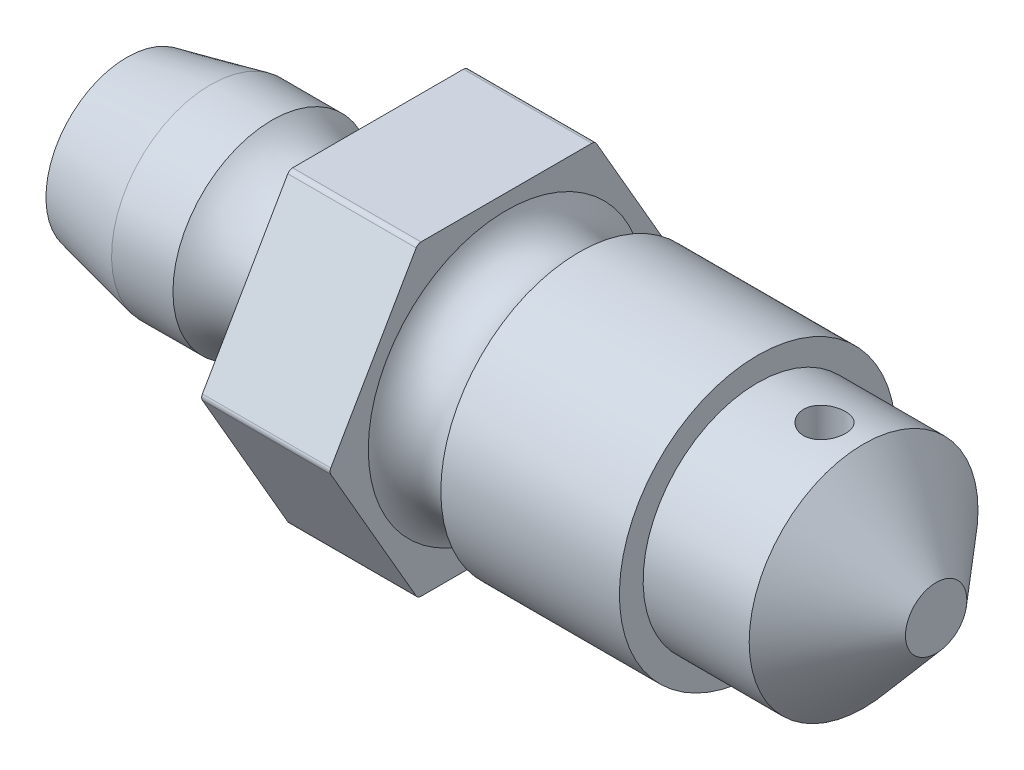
ISO-10303-21;
HEADER;
FILE_DESCRIPTION(('STEP AP214'),'2;1');
FILE_NAME('part.step','',(''),(''),'','','');
FILE_SCHEMA(('AUTOMOTIVE_DESIGN { 1 0 10303 214 1 1 1 1 }'));
ENDSEC;
DATA;
#1=APPLICATION_CONTEXT('core data for automotive mechanical design processes');
#2=APPLICATION_PROTOCOL_DEFINITION('international standard','automotive_design',2000,#1);
#3=PRODUCT_CONTEXT('',#1,'mechanical');
#4=PRODUCT('Part','Part','',(#3));
#5=PRODUCT_RELATED_PRODUCT_CATEGORY('part','',(#4));
#6=PRODUCT_DEFINITION_FORMATION('','',#4);
#7=PRODUCT_DEFINITION_CONTEXT('part definition',#1,'design');
#8=PRODUCT_DEFINITION('design','',#6,#7);
#9=PRODUCT_DEFINITION_SHAPE('','',#8);
#10=(LENGTH_UNIT() NAMED_UNIT(*) SI_UNIT(.MILLI.,.METRE.));
#11=(NAMED_UNIT(*) PLANE_ANGLE_UNIT() SI_UNIT($,.RADIAN.));
#12=(NAMED_UNIT(*) SI_UNIT($,.STERADIAN.) SOLID_ANGLE_UNIT());
#13=UNCERTAINTY_MEASURE_WITH_UNIT(LENGTH_MEASURE(1.E-05),#10,'distance_accuracy_value','');
#14=(GEOMETRIC_REPRESENTATION_CONTEXT(3) GLOBAL_UNCERTAINTY_ASSIGNED_CONTEXT((#13)) GLOBAL_UNIT_ASSIGNED_CONTEXT((#10,
#11,#12)) REPRESENTATION_CONTEXT('',''));
#15=CARTESIAN_POINT('',(0.,0.,0.));
#16=DIRECTION('',(0.,0.,1.));
#17=DIRECTION('',(1.,0.,0.));
#18=AXIS2_PLACEMENT_3D('',#15,#16,#17);
#19=CARTESIAN_POINT('',(9.,3.55,0.));
#20=DIRECTION('',(-1.,0.,0.));
#21=DIRECTION('',(0.,-1.,0.));
#22=AXIS2_PLACEMENT_3D('',#19,#20,#21);
#23=PLANE('',#22);
#24=CARTESIAN_POINT('',(9.,0.,0.));
#25=DIRECTION('',(-1.,0.,0.));
#26=DIRECTION('',(0.,0.,1.));
#27=AXIS2_PLACEMENT_3D('',#24,#25,#26);
#28=CIRCLE('',#27,3.55);
#29=CARTESIAN_POINT('',(9.,0.,3.55));
#30=VERTEX_POINT('',#29);
#31=EDGE_CURVE('E146',#30,#30,#28,.T.);
#32=ORIENTED_EDGE('',*,*,#31,.F.);
#33=EDGE_LOOP('',(#32));
#34=FACE_BOUND('',#33,.T.);
#35=DIRECTION('',(0.,0.866025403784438,-0.5));
#36=VECTOR('',#35,1.);
#37=CARTESIAN_POINT('',(9.,0.,6.35085296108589));
#38=LINE('',#37,#36);
#39=CARTESIAN_POINT('',(9.,0.1,6.29311793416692));
#40=VERTEX_POINT('',#39);
#41=CARTESIAN_POINT('',(9.,5.4,3.2331615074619));
#42=VERTEX_POINT('',#41);
#43=EDGE_CURVE('E348',#40,#42,#38,.T.);
#44=ORIENTED_EDGE('',*,*,#43,.T.);
#45=CARTESIAN_POINT('',(9.,5.3,3.05995642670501));
#46=DIRECTION('',(-1.,0.,0.));
#47=DIRECTION('',(0.,-1.,0.));
#48=AXIS2_PLACEMENT_3D('',#45,#46,#47);
#49=CIRCLE('',#48,0.2);
#50=CARTESIAN_POINT('',(9.,5.5,3.05995642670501));
#51=VERTEX_POINT('',#50);
#52=EDGE_CURVE('E388',#42,#51,#49,.T.);
#53=ORIENTED_EDGE('',*,*,#52,.T.);
#54=DIRECTION('',(0.,0.,-1.));
#55=VECTOR('',#54,1.);
#56=CARTESIAN_POINT('',(9.,5.5,3.17542648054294));
#57=LINE('',#56,#55);
#58=CARTESIAN_POINT('',(9.,5.5,-3.05995642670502));
#59=VERTEX_POINT('',#58);
#60=EDGE_CURVE('E343',#51,#59,#57,.T.);
#61=ORIENTED_EDGE('',*,*,#60,.T.);
#62=CARTESIAN_POINT('',(9.,5.3,-3.05995642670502));
#63=DIRECTION('',(-1.,0.,0.));
#64=DIRECTION('',(0.,-1.,0.));
#65=AXIS2_PLACEMENT_3D('',#62,#63,#64);
#66=CIRCLE('',#65,0.2);
#67=CARTESIAN_POINT('',(9.,5.4,-3.2331615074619));
#68=VERTEX_POINT('',#67);
#69=EDGE_CURVE('E382',#59,#68,#66,.T.);
#70=ORIENTED_EDGE('',*,*,#69,.T.);
#71=DIRECTION('',(0.,-0.866025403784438,-0.5));
#72=VECTOR('',#71,1.);
#73=CARTESIAN_POINT('',(9.,5.5,-3.17542648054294));
#74=LINE('',#73,#72);
#75=CARTESIAN_POINT('',(9.,0.100000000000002,-6.29311793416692));
#76=VERTEX_POINT('',#75);
#77=EDGE_CURVE('E342',#68,#76,#74,.T.);
#78=ORIENTED_EDGE('',*,*,#77,.T.);
#79=CARTESIAN_POINT('',(9.,0.,-6.11991285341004));
#80=DIRECTION('',(-1.,0.,0.));
#81=DIRECTION('',(0.,-1.,0.));
#82=AXIS2_PLACEMENT_3D('',#79,#80,#81);
#83=CIRCLE('',#82,0.2);
#84=CARTESIAN_POINT('',(9.,-0.0999999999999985,-6.29311793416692));
#85=VERTEX_POINT('',#84);
#86=EDGE_CURVE('E341',#76,#85,#83,.T.);
#87=ORIENTED_EDGE('',*,*,#86,.T.);
#88=DIRECTION('',(0.,-0.866025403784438,0.5));
#89=VECTOR('',#88,1.);
#90=CARTESIAN_POINT('',(9.,0.,-6.35085296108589));
#91=LINE('',#90,#89);
#92=CARTESIAN_POINT('',(9.,-5.4,-3.2331615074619));
#93=VERTEX_POINT('',#92);
#94=EDGE_CURVE('E333',#85,#93,#91,.T.);
#95=ORIENTED_EDGE('',*,*,#94,.T.);
#96=CARTESIAN_POINT('',(9.,-5.3,-3.05995642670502));
#97=DIRECTION('',(-1.,0.,0.));
#98=DIRECTION('',(0.,-1.,0.));
#99=AXIS2_PLACEMENT_3D('',#96,#97,#98);
#100=CIRCLE('',#99,0.2);
#101=CARTESIAN_POINT('',(9.,-5.5,-3.05995642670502));
#102=VERTEX_POINT('',#101);
#103=EDGE_CURVE('E338',#93,#102,#100,.T.);
#104=ORIENTED_EDGE('',*,*,#103,.T.);
#105=DIRECTION('',(0.,0.,1.));
#106=VECTOR('',#105,1.);
#107=CARTESIAN_POINT('',(9.,-5.5,-3.17542648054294));
#108=LINE('',#107,#106);
#109=CARTESIAN_POINT('',(9.,-5.5,3.05995642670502));
#110=VERTEX_POINT('',#109);
#111=EDGE_CURVE('E189',#102,#110,#108,.T.);
#112=ORIENTED_EDGE('',*,*,#111,.T.);
#113=CARTESIAN_POINT('',(9.,-5.3,3.05995642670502));
#114=DIRECTION('',(-1.,0.,0.));
#115=DIRECTION('',(0.,-1.,0.));
#116=AXIS2_PLACEMENT_3D('',#113,#114,#115);
#117=CIRCLE('',#116,0.2);
#118=CARTESIAN_POINT('',(9.,-5.4,3.23316150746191));
#119=VERTEX_POINT('',#118);
#120=EDGE_CURVE('E355',#110,#119,#117,.T.);
#121=ORIENTED_EDGE('',*,*,#120,.T.);
#122=DIRECTION('',(0.,0.866025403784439,0.5));
#123=VECTOR('',#122,1.);
#124=CARTESIAN_POINT('',(9.,-5.5,3.17542648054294));
#125=LINE('',#124,#123);
#126=CARTESIAN_POINT('',(9.,-0.0999999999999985,6.29311793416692));
#127=VERTEX_POINT('',#126);
#128=EDGE_CURVE('E350',#119,#127,#125,.T.);
#129=ORIENTED_EDGE('',*,*,#128,.T.);
#130=CARTESIAN_POINT('',(9.,0.,6.11991285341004));
#131=DIRECTION('',(-1.,0.,0.));
#132=DIRECTION('',(0.,-1.,0.));
#133=AXIS2_PLACEMENT_3D('',#130,#131,#132);
#134=CIRCLE('',#133,0.2);
#135=EDGE_CURVE('E353',#127,#40,#134,.T.);
#136=ORIENTED_EDGE('',*,*,#135,.T.);
#137=EDGE_LOOP('',(#44,#53,#61,#70,#78,#87,#95,#104,#112,#121,#129,#136));
#138=FACE_BOUND('',#137,.T.);
#139=ADVANCED_FACE('F41',(#34,#138),#23,.T.);
#140=CARTESIAN_POINT('',(13.6,6.5,0.));
#141=DIRECTION('',(1.,0.,0.));
#142=DIRECTION('',(0.,1.,0.));
#143=AXIS2_PLACEMENT_3D('',#140,#141,#142);
#144=PLANE('',#143);
#145=CARTESIAN_POINT('',(13.6,0.,0.));
#146=DIRECTION('',(-1.,0.,0.));
#147=DIRECTION('',(0.,0.,1.));
#148=AXIS2_PLACEMENT_3D('',#145,#146,#147);
#149=CIRCLE('',#148,4.95);
#150=CARTESIAN_POINT('',(13.6,0.,4.95));
#151=VERTEX_POINT('',#150);
#152=EDGE_CURVE('E153',#151,#151,#149,.T.);
#153=ORIENTED_EDGE('',*,*,#152,.T.);
#154=EDGE_LOOP('',(#153));
#155=FACE_BOUND('',#154,.T.);
#156=DIRECTION('',(0.,0.,1.));
#157=VECTOR('',#156,1.);
#158=CARTESIAN_POINT('',(13.6,5.5,0.));
#159=LINE('',#158,#157);
#160=CARTESIAN_POINT('',(13.6,5.5,-3.05995642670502));
#161=VERTEX_POINT('',#160);
#162=CARTESIAN_POINT('',(13.6,5.5,3.05995642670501));
#163=VERTEX_POINT('',#162);
#164=EDGE_CURVE('E397',#161,#163,#159,.T.);
#165=ORIENTED_EDGE('',*,*,#164,.T.);
#166=CARTESIAN_POINT('',(13.6,5.3,3.05995642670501));
#167=DIRECTION('',(1.,0.,0.));
#168=DIRECTION('',(0.,1.,0.));
#169=AXIS2_PLACEMENT_3D('',#166,#167,#168);
#170=CIRCLE('',#169,0.2);
#171=CARTESIAN_POINT('',(13.6,5.4,3.2331615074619));
#172=VERTEX_POINT('',#171);
#173=EDGE_CURVE('E312',#163,#172,#170,.T.);
#174=ORIENTED_EDGE('',*,*,#173,.T.);
#175=DIRECTION('',(0.,-0.866025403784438,0.5));
#176=VECTOR('',#175,1.);
#177=CARTESIAN_POINT('',(13.6,7.625,1.94855715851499));
#178=LINE('',#177,#176);
#179=CARTESIAN_POINT('',(13.6,0.0999999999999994,6.29311793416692));
#180=VERTEX_POINT('',#179);
#181=EDGE_CURVE('E403',#172,#180,#178,.T.);
#182=ORIENTED_EDGE('',*,*,#181,.T.);
#183=CARTESIAN_POINT('',(13.6,0.,6.11991285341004));
#184=DIRECTION('',(1.,0.,0.));
#185=DIRECTION('',(0.,1.,0.));
#186=AXIS2_PLACEMENT_3D('',#183,#184,#185);
#187=CIRCLE('',#186,0.2);
#188=CARTESIAN_POINT('',(13.6,-0.0999999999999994,6.29311793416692));
#189=VERTEX_POINT('',#188);
#190=EDGE_CURVE('E310',#180,#189,#187,.T.);
#191=ORIENTED_EDGE('',*,*,#190,.T.);
#192=DIRECTION('',(0.,-0.866025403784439,-0.5));
#193=VECTOR('',#192,1.);
#194=CARTESIAN_POINT('',(13.6,2.125,7.57772228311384));
#195=LINE('',#194,#193);
#196=CARTESIAN_POINT('',(13.6,-5.4,3.23316150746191));
#197=VERTEX_POINT('',#196);
#198=EDGE_CURVE('E367',#189,#197,#195,.T.);
#199=ORIENTED_EDGE('',*,*,#198,.T.);
#200=CARTESIAN_POINT('',(13.6,-5.3,3.05995642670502));
#201=DIRECTION('',(1.,0.,0.));
#202=DIRECTION('',(0.,1.,0.));
#203=AXIS2_PLACEMENT_3D('',#200,#201,#202);
#204=CIRCLE('',#203,0.2);
#205=CARTESIAN_POINT('',(13.6,-5.5,3.05995642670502));
#206=VERTEX_POINT('',#205);
#207=EDGE_CURVE('E303',#197,#206,#204,.T.);
#208=ORIENTED_EDGE('',*,*,#207,.T.);
#209=DIRECTION('',(0.,0.,-1.));
#210=VECTOR('',#209,1.);
#211=CARTESIAN_POINT('',(13.6,-5.5,0.));
#212=LINE('',#211,#210);
#213=CARTESIAN_POINT('',(13.6,-5.5,-3.05995642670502));
#214=VERTEX_POINT('',#213);
#215=EDGE_CURVE('E366',#206,#214,#212,.T.);
#216=ORIENTED_EDGE('',*,*,#215,.T.);
#217=CARTESIAN_POINT('',(13.6,-5.3,-3.05995642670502));
#218=DIRECTION('',(1.,0.,0.));
#219=DIRECTION('',(0.,1.,0.));
#220=AXIS2_PLACEMENT_3D('',#217,#218,#219);
#221=CIRCLE('',#220,0.2);
#222=CARTESIAN_POINT('',(13.6,-5.4,-3.2331615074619));
#223=VERTEX_POINT('',#222);
#224=EDGE_CURVE('E300',#214,#223,#221,.T.);
#225=ORIENTED_EDGE('',*,*,#224,.T.);
#226=DIRECTION('',(0.,0.866025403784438,-0.5));
#227=VECTOR('',#226,1.);
#228=CARTESIAN_POINT('',(13.6,2.125,-7.57772228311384));
#229=LINE('',#228,#227);
#230=CARTESIAN_POINT('',(13.6,-0.0999999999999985,-6.29311793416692));
#231=VERTEX_POINT('',#230);
#232=EDGE_CURVE('E334',#223,#231,#229,.T.);
#233=ORIENTED_EDGE('',*,*,#232,.T.);
#234=CARTESIAN_POINT('',(13.6,0.,-6.11991285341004));
#235=DIRECTION('',(1.,0.,0.));
#236=DIRECTION('',(0.,1.,0.));
#237=AXIS2_PLACEMENT_3D('',#234,#235,#236);
#238=CIRCLE('',#237,0.2);
#239=CARTESIAN_POINT('',(13.6,0.100000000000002,-6.29311793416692));
#240=VERTEX_POINT('',#239);
#241=EDGE_CURVE('E62',#231,#240,#238,.T.);
#242=ORIENTED_EDGE('',*,*,#241,.T.);
#243=DIRECTION('',(0.,0.866025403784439,0.5));
#244=VECTOR('',#243,1.);
#245=CARTESIAN_POINT('',(13.6,7.625,-1.94855715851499));
#246=LINE('',#245,#244);
#247=CARTESIAN_POINT('',(13.6,5.4,-3.2331615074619));
#248=VERTEX_POINT('',#247);
#249=EDGE_CURVE('E374',#240,#248,#246,.T.);
#250=ORIENTED_EDGE('',*,*,#249,.T.);
#251=CARTESIAN_POINT('',(13.6,5.3,-3.05995642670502));
#252=DIRECTION('',(1.,0.,0.));
#253=DIRECTION('',(0.,1.,0.));
#254=AXIS2_PLACEMENT_3D('',#251,#252,#253);
#255=CIRCLE('',#254,0.2);
#256=EDGE_CURVE('E301',#248,#161,#255,.T.);
#257=ORIENTED_EDGE('',*,*,#256,.T.);
#258=EDGE_LOOP('',(#165,#174,#182,#191,#199,#208,#216,#225,#233,#242,#250,#257));
#259=FACE_BOUND('',#258,.T.);
#260=ADVANCED_FACE('F261',(#155,#259),#144,.T.);
#261=CARTESIAN_POINT('',(29.,0.,0.));
#262=DIRECTION('',(1.,0.,0.));
#263=DIRECTION('',(0.,1.,0.));
#264=AXIS2_PLACEMENT_3D('',#261,#262,#263);
#265=CYLINDRICAL_SURFACE('',#264,4.95);
#266=CARTESIAN_POINT('',(22.6,0.,0.));
#267=DIRECTION('',(1.,0.,0.));
#268=DIRECTION('',(0.,1.,0.));
#269=AXIS2_PLACEMENT_3D('',#266,#267,#268);
#270=CIRCLE('',#269,4.95);
#271=CARTESIAN_POINT('',(22.6,4.95,0.));
#272=VERTEX_POINT('',#271);
#273=EDGE_CURVE('E170',#272,#272,#270,.T.);
#274=ORIENTED_EDGE('',*,*,#273,.F.);
#275=EDGE_LOOP('',(#274));
#276=FACE_BOUND('',#275,.T.);
#277=CARTESIAN_POINT('',(16.2,0.,0.));
#278=DIRECTION('',(-1.,0.,0.));
#279=DIRECTION('',(0.,0.,1.));
#280=AXIS2_PLACEMENT_3D('',#277,#278,#279);
#281=CIRCLE('',#280,4.95);
#282=CARTESIAN_POINT('',(16.2,0.,4.95));
#283=VERTEX_POINT('',#282);
#284=EDGE_CURVE('E156',#283,#283,#281,.T.);
#285=ORIENTED_EDGE('',*,*,#284,.F.);
#286=EDGE_LOOP('',(#285));
#287=FACE_BOUND('',#286,.T.);
#288=ADVANCED_FACE('F267',(#276,#287),#265,.T.);
#289=CARTESIAN_POINT('',(22.6,4.95,0.));
#290=DIRECTION('',(1.,0.,0.));
#291=DIRECTION('',(0.,1.,0.));
#292=AXIS2_PLACEMENT_3D('',#289,#290,#291);
#293=PLANE('',#292);
#294=ORIENTED_EDGE('',*,*,#273,.T.);
#295=EDGE_LOOP('',(#294));
#296=FACE_BOUND('',#295,.T.);
#297=CARTESIAN_POINT('',(22.6,0.,0.));
#298=DIRECTION('',(1.,0.,0.));
#299=DIRECTION('',(0.,1.,0.));
#300=AXIS2_PLACEMENT_3D('',#297,#298,#299);
#301=CIRCLE('',#300,4.1);
#302=CARTESIAN_POINT('',(22.6,4.1,0.));
#303=VERTEX_POINT('',#302);
#304=EDGE_CURVE('E167',#303,#303,#301,.T.);
#305=ORIENTED_EDGE('',*,*,#304,.F.);
#306=EDGE_LOOP('',(#305));
#307=FACE_BOUND('',#306,.T.);
#308=ADVANCED_FACE('F418',(#296,#307),#293,.T.);
#309=CARTESIAN_POINT('',(29.,0.,0.));
#310=DIRECTION('',(1.,0.,0.));
#311=DIRECTION('',(0.,1.,0.));
#312=AXIS2_PLACEMENT_3D('',#309,#310,#311);
#313=CYLINDRICAL_SURFACE('',#312,4.1);
#314=CARTESIAN_POINT('',(24.25,4.1,0.));
#315=CARTESIAN_POINT('',(24.2500016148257,4.09999925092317,0.0417545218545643));
#316=CARTESIAN_POINT('',(24.2534986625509,4.09935555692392,0.0835302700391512));
#317=CARTESIAN_POINT('',(24.2673861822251,4.09684976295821,0.165905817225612));
#318=CARTESIAN_POINT('',(24.2777825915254,4.09498661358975,0.206504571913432));
#319=CARTESIAN_POINT('',(24.3051408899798,4.09025045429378,0.285322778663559));
#320=CARTESIAN_POINT('',(24.3220969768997,4.08737833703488,0.323544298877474));
#321=CARTESIAN_POINT('',(24.3620771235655,4.08093836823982,0.396596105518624));
#322=CARTESIAN_POINT('',(24.3851006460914,4.07737057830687,0.431426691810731));
#323=CARTESIAN_POINT('',(24.4368414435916,4.06988788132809,0.497109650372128));
#324=CARTESIAN_POINT('',(24.4656145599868,4.06596979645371,0.527917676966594));
#325=CARTESIAN_POINT('',(24.52791763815,4.05825185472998,0.584297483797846));
#326=CARTESIAN_POINT('',(24.5614479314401,4.05445200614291,0.609868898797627));
#327=CARTESIAN_POINT('',(24.6326249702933,4.0473699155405,0.65523252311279));
#328=CARTESIAN_POINT('',(24.6703007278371,4.04409177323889,0.674979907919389));
#329=CARTESIAN_POINT('',(24.7485049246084,4.0384688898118,0.707848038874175));
#330=CARTESIAN_POINT('',(24.789033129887,4.03612407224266,0.720969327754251));
#331=CARTESIAN_POINT('',(24.8713182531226,4.03266523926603,0.740071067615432));
#332=CARTESIAN_POINT('',(24.9130566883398,4.03153793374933,0.74612868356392));
#333=CARTESIAN_POINT('',(24.9969715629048,4.03060166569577,0.751170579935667));
#334=CARTESIAN_POINT('',(25.03914796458,4.03079259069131,0.750155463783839));
#335=CARTESIAN_POINT('',(25.1221843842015,4.0324591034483,0.741143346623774));
#336=CARTESIAN_POINT('',(25.1630542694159,4.03391859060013,0.733233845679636));
#337=CARTESIAN_POINT('',(25.2428770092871,4.03793251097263,0.710795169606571));
#338=CARTESIAN_POINT('',(25.2818297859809,4.04048698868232,0.696265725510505));
#339=CARTESIAN_POINT('',(25.3569699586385,4.04642002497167,0.660913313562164));
#340=CARTESIAN_POINT('',(25.3931402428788,4.04980321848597,0.640054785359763));
#341=CARTESIAN_POINT('',(25.4615003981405,4.05700938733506,0.59266147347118));
#342=CARTESIAN_POINT('',(25.4936898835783,4.06083240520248,0.566126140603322));
#343=CARTESIAN_POINT('',(25.5536804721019,4.068557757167,0.507659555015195));
#344=CARTESIAN_POINT('',(25.5814085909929,4.07246042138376,0.475653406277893));
#345=CARTESIAN_POINT('',(25.6311127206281,4.0798526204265,0.407404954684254));
#346=CARTESIAN_POINT('',(25.6530886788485,4.08334215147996,0.371162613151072));
#347=CARTESIAN_POINT('',(25.6906744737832,4.08952144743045,0.295396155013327));
#348=CARTESIAN_POINT('',(25.7062769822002,4.09221029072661,0.255868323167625));
#349=CARTESIAN_POINT('',(25.7306005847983,4.09647807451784,0.174692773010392));
#350=CARTESIAN_POINT('',(25.7393223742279,4.09805712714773,0.133045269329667));
#351=CARTESIAN_POINT('',(25.7495359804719,4.09991208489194,0.049440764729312));
#352=CARTESIAN_POINT('',(25.7511278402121,4.10020602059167,0.0074963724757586));
#353=CARTESIAN_POINT('',(25.7473043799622,4.09950733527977,-0.0760593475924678));
#354=CARTESIAN_POINT('',(25.741889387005,4.0985147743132,-0.117670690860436));
#355=CARTESIAN_POINT('',(25.7242891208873,4.09536583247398,-0.199063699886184));
#356=CARTESIAN_POINT('',(25.7121542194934,4.09321811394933,-0.238856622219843));
#357=CARTESIAN_POINT('',(25.6815129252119,4.08799867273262,-0.315843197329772));
#358=CARTESIAN_POINT('',(25.6630061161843,4.0849268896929,-0.353036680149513));
#359=CARTESIAN_POINT('',(25.6199231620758,4.07815509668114,-0.42419729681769));
#360=CARTESIAN_POINT('',(25.5952855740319,4.0744488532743,-0.458126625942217));
#361=CARTESIAN_POINT('',(25.5407238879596,4.06683590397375,-0.521405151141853));
#362=CARTESIAN_POINT('',(25.5107993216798,4.0629291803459,-0.550753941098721));
#363=CARTESIAN_POINT('',(25.4460611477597,4.0552961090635,-0.604416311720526));
#364=CARTESIAN_POINT('',(25.4111906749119,4.05157265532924,-0.628661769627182));
#365=CARTESIAN_POINT('',(25.337813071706,4.04478495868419,-0.670951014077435));
#366=CARTESIAN_POINT('',(25.2993060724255,4.04172069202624,-0.688995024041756));
#367=CARTESIAN_POINT('',(25.2199254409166,4.03662080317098,-0.718271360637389));
#368=CARTESIAN_POINT('',(25.1790638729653,4.03458038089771,-0.729535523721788));
#369=CARTESIAN_POINT('',(25.0959875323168,4.03174798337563,-0.745031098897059));
#370=CARTESIAN_POINT('',(25.0537729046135,4.03095587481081,-0.749263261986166));
#371=CARTESIAN_POINT('',(24.9698706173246,4.03071632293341,-0.750550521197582));
#372=CARTESIAN_POINT('',(24.9281846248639,4.03124875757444,-0.747713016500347));
#373=CARTESIAN_POINT('',(24.8458943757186,4.03355380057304,-0.735175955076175));
#374=CARTESIAN_POINT('',(24.8052901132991,4.03532640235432,-0.725476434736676));
#375=CARTESIAN_POINT('',(24.7263699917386,4.03990376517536,-0.699535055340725));
#376=CARTESIAN_POINT('',(24.688050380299,4.04270677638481,-0.683304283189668));
#377=CARTESIAN_POINT('',(24.6146609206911,4.04903046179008,-0.644772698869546));
#378=CARTESIAN_POINT('',(24.5795912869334,4.0525511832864,-0.622471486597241));
#379=CARTESIAN_POINT('',(24.5131582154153,4.05997636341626,-0.572056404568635));
#380=CARTESIAN_POINT('',(24.4818547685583,4.06388557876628,-0.54386417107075));
#381=CARTESIAN_POINT('',(24.4243869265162,4.07161116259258,-0.482631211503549));
#382=CARTESIAN_POINT('',(24.3982237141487,4.07542750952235,-0.449589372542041));
#383=CARTESIAN_POINT('',(24.3515719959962,4.0825753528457,-0.3792588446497));
#384=CARTESIAN_POINT('',(24.3311336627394,4.08590244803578,-0.341936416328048));
#385=CARTESIAN_POINT('',(24.2968497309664,4.09165400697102,-0.264339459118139));
#386=CARTESIAN_POINT('',(24.2829978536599,4.09407932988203,-0.224067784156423));
#387=CARTESIAN_POINT('',(24.2651374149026,4.09725156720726,-0.153057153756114));
#388=CARTESIAN_POINT('',(24.2594704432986,4.0982764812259,-0.122736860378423));
#389=CARTESIAN_POINT('',(24.251901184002,4.09965096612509,-0.0616148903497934));
#390=CARTESIAN_POINT('',(24.249998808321,4.10000055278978,-0.0308132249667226));
#391=CARTESIAN_POINT('',(24.25,4.1,0.));
#392=B_SPLINE_CURVE_WITH_KNOTS('',3,(#314,#315,#316,#317,#318,#319,#320,#321,#322,#323,#324,
#325,#326,#327,#328,#329,#330,#331,#332,#333,#334,#335,#336,#337,#338,#339,#340,#341,#342,#343,
#344,#345,#346,#347,#348,#349,#350,#351,#352,#353,#354,#355,#356,#357,#358,#359,#360,#361,#362,
#363,#364,#365,#366,#367,#368,#369,#370,#371,#372,#373,#374,#375,#376,#377,#378,#379,#380,#381,
#382,#383,#384,#385,#386,#387,#388,#389,#390,#391),.UNSPECIFIED.,.T.,.F.,(4,2,2,2,2,2,2,2,2,2,2,
2,2,2,2,2,2,2,2,2,2,2,2,2,2,2,2,2,2,2,2,2,2,2,2,2,2,2,4),(0.,0.125150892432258,
0.250409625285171,0.375557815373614,0.500694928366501,0.627112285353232,0.753538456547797,
0.880913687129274,1.00827848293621,1.13423848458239,1.26018773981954,1.3845614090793,
1.50894013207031,1.63403104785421,1.75913407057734,1.8861116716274,2.01309043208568,
2.14021478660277,2.26732629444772,2.39264854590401,2.51796494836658,2.64235446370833,
2.76675210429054,2.89245056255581,3.0181601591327,3.14545412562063,3.27274350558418,
3.39943040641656,3.52610377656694,3.65086455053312,3.77562466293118,3.90017388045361,
4.02473130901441,4.15106517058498,4.27742806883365,4.40486602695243,4.5321822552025,
4.6245409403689,4.71689746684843),.UNSPECIFIED.);
#393=CARTESIAN_POINT('',(24.25,4.1,0.));
#394=VERTEX_POINT('',#393);
#395=EDGE_CURVE('E179',#394,#394,#392,.T.);
#396=ORIENTED_EDGE('',*,*,#395,.F.);
#397=EDGE_LOOP('',(#396));
#398=FACE_BOUND('',#397,.T.);
#399=CARTESIAN_POINT('',(25.,-4.03081877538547,0.749999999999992));
#400=CARTESIAN_POINT('',(24.9582520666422,-4.03081957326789,0.749998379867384));
#401=CARTESIAN_POINT('',(24.9164828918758,-4.03147440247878,0.746502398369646));
#402=CARTESIAN_POINT('',(24.8341209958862,-4.03401990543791,0.732619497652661));
#403=CARTESIAN_POINT('',(24.7935293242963,-4.03591164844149,0.72222661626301));
#404=CARTESIAN_POINT('',(24.7147261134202,-4.04070971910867,0.694878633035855));
#405=CARTESIAN_POINT('',(24.6765124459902,-4.04361512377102,0.677929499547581));
#406=CARTESIAN_POINT('',(24.6034738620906,-4.05011205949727,0.637965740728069));
#407=CARTESIAN_POINT('',(24.5686486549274,-4.05370353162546,0.614951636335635));
#408=CARTESIAN_POINT('',(24.5029598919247,-4.06121547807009,0.563220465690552));
#409=CARTESIAN_POINT('',(24.4721423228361,-4.06513904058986,0.534445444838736));
#410=CARTESIAN_POINT('',(24.415744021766,-4.07284577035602,0.472134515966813));
#411=CARTESIAN_POINT('',(24.3901636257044,-4.07662892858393,0.438598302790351));
#412=CARTESIAN_POINT('',(24.3447903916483,-4.08366158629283,0.367415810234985));
#413=CARTESIAN_POINT('',(24.3250407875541,-4.08690702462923,0.329741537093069));
#414=CARTESIAN_POINT('',(24.2921681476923,-4.09246404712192,0.251540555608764));
#415=CARTESIAN_POINT('',(24.2790445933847,-4.094775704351,0.211014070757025));
#416=CARTESIAN_POINT('',(24.2599384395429,-4.0981828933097,0.128735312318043));
#417=CARTESIAN_POINT('',(24.2538783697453,-4.09929160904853,0.0870015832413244));
#418=CARTESIAN_POINT('',(24.2488299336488,-4.10021340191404,0.00309600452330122));
#419=CARTESIAN_POINT('',(24.2498409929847,-4.10002658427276,-0.0390758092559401));
#420=CARTESIAN_POINT('',(24.2588464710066,-4.09838869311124,-0.122129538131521));
#421=CARTESIAN_POINT('',(24.2667574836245,-4.09695271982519,-0.163020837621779));
#422=CARTESIAN_POINT('',(24.2892065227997,-4.09299477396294,-0.24288561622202));
#423=CARTESIAN_POINT('',(24.3037447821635,-4.0904727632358,-0.28185902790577));
#424=CARTESIAN_POINT('',(24.3391158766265,-4.08460076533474,-0.357025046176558));
#425=CARTESIAN_POINT('',(24.3599822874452,-4.08124637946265,-0.393201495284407));
#426=CARTESIAN_POINT('',(24.4073926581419,-4.07408099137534,-0.461570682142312));
#427=CARTESIAN_POINT('',(24.4339371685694,-4.07026994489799,-0.49376303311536));
#428=CARTESIAN_POINT('',(24.4924105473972,-4.06254808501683,-0.553744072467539));
#429=CARTESIAN_POINT('',(24.5244123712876,-4.05863662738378,-0.581461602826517));
#430=CARTESIAN_POINT('',(24.5926483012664,-4.051208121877,-0.631146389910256));
#431=CARTESIAN_POINT('',(24.6288824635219,-4.04769107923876,-0.653113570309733));
#432=CARTESIAN_POINT('',(24.7046461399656,-4.04144880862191,-0.690692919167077));
#433=CARTESIAN_POINT('',(24.7441806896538,-4.03872482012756,-0.706295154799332));
#434=CARTESIAN_POINT('',(24.8253709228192,-4.03439637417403,-0.730616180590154));
#435=CARTESIAN_POINT('',(24.8670263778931,-4.03279179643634,-0.739335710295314));
#436=CARTESIAN_POINT('',(24.9506354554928,-4.03090753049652,-0.749540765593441));
#437=CARTESIAN_POINT('',(24.9925762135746,-4.03060915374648,-0.751128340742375));
#438=CARTESIAN_POINT('',(25.0761236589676,-4.03132111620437,-0.747297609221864));
#439=CARTESIAN_POINT('',(25.1177303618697,-4.03233139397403,-0.741879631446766));
#440=CARTESIAN_POINT('',(25.1990957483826,-4.03552945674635,-0.724279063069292));
#441=CARTESIAN_POINT('',(25.2388663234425,-4.03770798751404,-0.71214961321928));
#442=CARTESIAN_POINT('',(25.3158105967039,-4.04298916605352,-0.681526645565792));
#443=CARTESIAN_POINT('',(25.3529841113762,-4.0460918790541,-0.663032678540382));
#444=CARTESIAN_POINT('',(25.4241296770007,-4.05291458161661,-0.619969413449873));
#445=CARTESIAN_POINT('',(25.4580619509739,-4.05664099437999,-0.595335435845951));
#446=CARTESIAN_POINT('',(25.5213480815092,-4.06427299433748,-0.540778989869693));
#447=CARTESIAN_POINT('',(25.550701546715,-4.06817859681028,-0.510856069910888));
#448=CARTESIAN_POINT('',(25.6043761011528,-4.0757887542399,-0.446116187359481));
#449=CARTESIAN_POINT('',(25.6286286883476,-4.07949013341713,-0.411241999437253));
#450=CARTESIAN_POINT('',(25.6709304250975,-4.08622195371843,-0.337854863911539));
#451=CARTESIAN_POINT('',(25.68897980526,-4.08925241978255,-0.299342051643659));
#452=CARTESIAN_POINT('',(25.7182592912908,-4.09428727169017,-0.219963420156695));
#453=CARTESIAN_POINT('',(25.7295235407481,-4.096296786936,-0.179110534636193));
#454=CARTESIAN_POINT('',(25.7450222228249,-4.09908515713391,-0.096052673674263));
#455=CARTESIAN_POINT('',(25.749257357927,-4.09986413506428,-0.0538478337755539));
#456=CARTESIAN_POINT('',(25.7505541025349,-4.10010137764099,0.0300580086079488));
#457=CARTESIAN_POINT('',(25.7477193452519,-4.09957872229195,0.0717573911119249));
#458=CARTESIAN_POINT('',(25.735183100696,-4.09731091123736,0.154075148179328));
#459=CARTESIAN_POINT('',(25.7254816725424,-4.09556576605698,0.194693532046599));
#460=CARTESIAN_POINT('',(25.6995302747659,-4.09104886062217,0.273644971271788));
#461=CARTESIAN_POINT('',(25.6832908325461,-4.08827875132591,0.311981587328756));
#462=CARTESIAN_POINT('',(25.644736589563,-4.08201235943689,0.385401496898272));
#463=CARTESIAN_POINT('',(25.6224214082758,-4.07851603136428,0.420484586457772));
#464=CARTESIAN_POINT('',(25.5719899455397,-4.07112312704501,0.486919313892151));
#465=CARTESIAN_POINT('',(25.5437985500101,-4.06722173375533,0.518213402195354));
#466=CARTESIAN_POINT('',(25.4825712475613,-4.05948946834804,0.575662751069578));
#467=CARTESIAN_POINT('',(25.4495342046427,-4.05565861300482,0.601816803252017));
#468=CARTESIAN_POINT('',(25.379208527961,-4.04846468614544,0.648457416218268));
#469=CARTESIAN_POINT('',(25.3418852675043,-4.04510599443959,0.668892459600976));
#470=CARTESIAN_POINT('',(25.2642867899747,-4.03928913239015,0.703170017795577));
#471=CARTESIAN_POINT('',(25.2240144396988,-4.03683010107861,0.717018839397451));
#472=CARTESIAN_POINT('',(25.1530117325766,-4.03361126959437,0.734871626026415));
#473=CARTESIAN_POINT('',(25.1227005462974,-4.03257021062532,0.740535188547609));
#474=CARTESIAN_POINT('',(25.061596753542,-4.03117367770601,0.748099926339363));
#475=CARTESIAN_POINT('',(25.0308041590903,-4.03081818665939,0.750001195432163));
#476=CARTESIAN_POINT('',(25.,-4.03081877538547,0.749999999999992));
#477=B_SPLINE_CURVE_WITH_KNOTS('',3,(#399,#400,#401,#402,#403,#404,#405,#406,#407,#408,#409,
#410,#411,#412,#413,#414,#415,#416,#417,#418,#419,#420,#421,#422,#423,#424,#425,#426,#427,#428,
#429,#430,#431,#432,#433,#434,#435,#436,#437,#438,#439,#440,#441,#442,#443,#444,#445,#446,#447,
#448,#449,#450,#451,#452,#453,#454,#455,#456,#457,#458,#459,#460,#461,#462,#463,#464,#465,#466,
#467,#468,#469,#470,#471,#472,#473,#474,#475,#476),.UNSPECIFIED.,.T.,.F.,(4,2,2,2,2,2,2,2,2,2,2,
2,2,2,2,2,2,2,2,2,2,2,2,2,2,2,2,2,2,2,2,2,2,2,2,2,2,2,4),(0.,0.125131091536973,
0.250370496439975,0.375496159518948,0.500611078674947,0.627054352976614,0.753505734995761,
0.880872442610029,1.00822918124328,1.13417555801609,1.26011170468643,1.38454631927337,
1.50898530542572,1.63409644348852,1.75921971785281,1.88616984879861,2.01312166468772,
2.1402708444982,2.26740636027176,2.39271680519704,2.51802136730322,2.64234769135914,
2.76668279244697,2.89238752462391,3.01810299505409,3.14541192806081,3.27271612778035,
3.39937424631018,3.52601970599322,3.65081968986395,3.77561859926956,3.90021735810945,
4.02482392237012,4.15113345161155,4.27747263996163,4.4049157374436,4.53223655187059,
4.62456816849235,4.71689748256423),.UNSPECIFIED.);
#478=CARTESIAN_POINT('',(25.,-4.03081877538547,0.749999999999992));
#479=VERTEX_POINT('',#478);
#480=EDGE_CURVE('E180',#479,#479,#477,.T.);
#481=ORIENTED_EDGE('',*,*,#480,.F.);
#482=EDGE_LOOP('',(#481));
#483=FACE_BOUND('',#482,.T.);
#484=ORIENTED_EDGE('',*,*,#304,.T.);
#485=EDGE_LOOP('',(#484));
#486=FACE_BOUND('',#485,.T.);
#487=CARTESIAN_POINT('',(26.4,0.,0.));
#488=DIRECTION('',(1.,0.,0.));
#489=DIRECTION('',(0.,1.,0.));
#490=AXIS2_PLACEMENT_3D('',#487,#488,#489);
#491=CIRCLE('',#490,4.1);
#492=CARTESIAN_POINT('',(26.4,-4.1,0.));
#493=VERTEX_POINT('',#492);
#494=EDGE_CURVE('E164',#493,#493,#491,.T.);
#495=ORIENTED_EDGE('',*,*,#494,.F.);
#496=EDGE_LOOP('',(#495));
#497=FACE_BOUND('',#496,.T.);
#498=ADVANCED_FACE('F194',(#398,#483,#486,#497),#313,.T.);
#499=CARTESIAN_POINT('',(29.,0.,0.));
#500=DIRECTION('',(-1.,0.,0.));
#501=DIRECTION('',(0.,-1.,0.));
#502=AXIS2_PLACEMENT_3D('',#499,#500,#501);
#503=CONICAL_SURFACE('',#502,1.1,0.856705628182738);
#504=CARTESIAN_POINT('',(29.,0.,0.));
#505=DIRECTION('',(1.,0.,0.));
#506=DIRECTION('',(0.,1.,0.));
#507=AXIS2_PLACEMENT_3D('',#504,#505,#506);
#508=CIRCLE('',#507,1.1);
#509=CARTESIAN_POINT('',(29.,-1.1,0.));
#510=VERTEX_POINT('',#509);
#511=EDGE_CURVE('E158',#510,#510,#508,.T.);
#512=CARTESIAN_POINT('',(26.4,-4.1,0.));
#513=CARTESIAN_POINT('',(26.4270833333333,-4.06875,0.));
#514=CARTESIAN_POINT('',(26.4541666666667,-4.0375,0.));
#515=CARTESIAN_POINT('',(26.5083333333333,-3.975,0.));
#516=CARTESIAN_POINT('',(26.5354166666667,-3.94375,0.));
#517=CARTESIAN_POINT('',(26.5895833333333,-3.88125,0.));
#518=CARTESIAN_POINT('',(26.6166666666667,-3.85,0.));
#519=CARTESIAN_POINT('',(26.6708333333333,-3.7875,0.));
#520=CARTESIAN_POINT('',(26.6979166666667,-3.75625,0.));
#521=CARTESIAN_POINT('',(26.7520833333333,-3.69375,0.));
#522=CARTESIAN_POINT('',(26.7791666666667,-3.6625,0.));
#523=CARTESIAN_POINT('',(26.8333333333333,-3.6,0.));
#524=CARTESIAN_POINT('',(26.8604166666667,-3.56875,0.));
#525=CARTESIAN_POINT('',(26.9145833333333,-3.50625,0.));
#526=CARTESIAN_POINT('',(26.9416666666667,-3.475,0.));
#527=CARTESIAN_POINT('',(26.9958333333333,-3.4125,0.));
#528=CARTESIAN_POINT('',(27.0229166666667,-3.38125,0.));
#529=CARTESIAN_POINT('',(27.0770833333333,-3.31875,0.));
#530=CARTESIAN_POINT('',(27.1041666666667,-3.2875,0.));
#531=CARTESIAN_POINT('',(27.1583333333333,-3.225,0.));
#532=CARTESIAN_POINT('',(27.1854166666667,-3.19375,0.));
#533=CARTESIAN_POINT('',(27.2395833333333,-3.13125,0.));
#534=CARTESIAN_POINT('',(27.2666666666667,-3.1,0.));
#535=CARTESIAN_POINT('',(27.3208333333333,-3.0375,0.));
#536=CARTESIAN_POINT('',(27.3479166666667,-3.00625,0.));
#537=CARTESIAN_POINT('',(27.4020833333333,-2.94375,0.));
#538=CARTESIAN_POINT('',(27.4291666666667,-2.9125,0.));
#539=CARTESIAN_POINT('',(27.4833333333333,-2.85,0.));
#540=CARTESIAN_POINT('',(27.5104166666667,-2.81875,0.));
#541=CARTESIAN_POINT('',(27.5645833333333,-2.75625,0.));
#542=CARTESIAN_POINT('',(27.5916666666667,-2.725,0.));
#543=CARTESIAN_POINT('',(27.6458333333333,-2.6625,0.));
#544=CARTESIAN_POINT('',(27.6729166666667,-2.63125,0.));
#545=CARTESIAN_POINT('',(27.7270833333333,-2.56875,0.));
#546=CARTESIAN_POINT('',(27.7541666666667,-2.5375,0.));
#547=CARTESIAN_POINT('',(27.8083333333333,-2.475,0.));
#548=CARTESIAN_POINT('',(27.8354166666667,-2.44375,0.));
#549=CARTESIAN_POINT('',(27.8895833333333,-2.38125,0.));
#550=CARTESIAN_POINT('',(27.9166666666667,-2.35,0.));
#551=CARTESIAN_POINT('',(27.9708333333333,-2.2875,0.));
#552=CARTESIAN_POINT('',(27.9979166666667,-2.25625,0.));
#553=CARTESIAN_POINT('',(28.0520833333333,-2.19375,0.));
#554=CARTESIAN_POINT('',(28.0791666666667,-2.1625,0.));
#555=CARTESIAN_POINT('',(28.1333333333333,-2.1,0.));
#556=CARTESIAN_POINT('',(28.1604166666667,-2.06875,0.));
#557=CARTESIAN_POINT('',(28.2145833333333,-2.00625,0.));
#558=CARTESIAN_POINT('',(28.2416666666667,-1.975,0.));
#559=CARTESIAN_POINT('',(28.2958333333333,-1.9125,0.));
#560=CARTESIAN_POINT('',(28.3229166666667,-1.88125,0.));
#561=CARTESIAN_POINT('',(28.3770833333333,-1.81875,0.));
#562=CARTESIAN_POINT('',(28.4041666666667,-1.7875,0.));
#563=CARTESIAN_POINT('',(28.4583333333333,-1.725,0.));
#564=CARTESIAN_POINT('',(28.4854166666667,-1.69375,0.));
#565=CARTESIAN_POINT('',(28.5395833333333,-1.63125,0.));
#566=CARTESIAN_POINT('',(28.5666666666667,-1.6,0.));
#567=CARTESIAN_POINT('',(28.6208333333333,-1.5375,0.));
#568=CARTESIAN_POINT('',(28.6479166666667,-1.50625,0.));
#569=CARTESIAN_POINT('',(28.7020833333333,-1.44375,0.));
#570=CARTESIAN_POINT('',(28.7291666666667,-1.4125,0.));
#571=CARTESIAN_POINT('',(28.7833333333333,-1.35,0.));
#572=CARTESIAN_POINT('',(28.8104166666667,-1.31875,0.));
#573=CARTESIAN_POINT('',(28.8645833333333,-1.25625,0.));
#574=CARTESIAN_POINT('',(28.8916666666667,-1.225,0.));
#575=CARTESIAN_POINT('',(28.9458333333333,-1.1625,0.));
#576=CARTESIAN_POINT('',(28.9729166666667,-1.13125,0.));
#577=CARTESIAN_POINT('',(29.,-1.1,0.));
#578=B_SPLINE_CURVE_WITH_KNOTS('',3,(#512,#513,#514,#515,#516,#517,#518,#519,#520,#521,#522,
#523,#524,#525,#526,#527,#528,#529,#530,#531,#532,#533,#534,#535,#536,#537,#538,#539,#540,#541,
#542,#543,#544,#545,#546,#547,#548,#549,#550,#551,#552,#553,#554,#555,#556,#557,#558,#559,#560,
#561,#562,#563,#564,#565,#566,#567,#568,#569,#570,#571,#572,#573,#574,#575,#576,#577),
.UNSPECIFIED.,.F.,.F.,(4,2,2,2,2,2,2,2,2,2,2,2,2,2,2,2,2,2,2,2,2,2,2,2,2,2,2,2,2,2,2,2,4),(0.,
0.124058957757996,0.248117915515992,0.372176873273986,0.496235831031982,0.620294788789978,
0.744353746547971,0.868412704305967,0.992471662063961,1.11653061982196,1.24058957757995,
1.36464853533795,1.48870749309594,1.61276645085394,1.73682540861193,1.86088436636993,
1.98494332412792,2.10900228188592,2.23306123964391,2.35712019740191,2.4811791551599,
2.6052381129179,2.72929707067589,2.85335602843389,2.97741498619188,3.10147394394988,
3.22553290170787,3.34959185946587,3.47365081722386,3.59770977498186,3.72176873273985,
3.84582769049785,3.96988664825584),.UNSPECIFIED.);
#579=EDGE_CURVE('BSEAM417',#493,#510,#578,.T.);
#580=ORIENTED_EDGE('',*,*,#494,.T.);
#581=ORIENTED_EDGE('',*,*,#511,.F.);
#582=ORIENTED_EDGE('',*,*,#579,.T.);
#583=ORIENTED_EDGE('',*,*,#579,.F.);
#584=EDGE_LOOP('',(#580,#582,#581,#583));
#585=FACE_BOUND('',#584,.T.);
#586=ADVANCED_FACE('F417',(#585),#503,.T.);
#587=CARTESIAN_POINT('',(29.,1.1,0.));
#588=DIRECTION('',(1.,0.,0.));
#589=DIRECTION('',(0.,1.,0.));
#590=AXIS2_PLACEMENT_3D('',#587,#588,#589);
#591=PLANE('',#590);
#592=ORIENTED_EDGE('',*,*,#511,.T.);
#593=EDGE_LOOP('',(#592));
#594=FACE_BOUND('',#593,.T.);
#595=ADVANCED_FACE('F256',(#594),#591,.T.);
#596=CARTESIAN_POINT('',(14.9,0.,0.));
#597=DIRECTION('',(-1.,0.,0.));
#598=DIRECTION('',(0.,0.,1.));
#599=AXIS2_PLACEMENT_3D('',#596,#597,#598);
#600=TOROIDAL_SURFACE('',#599,5.43888888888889,1.38888888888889);
#601=ORIENTED_EDGE('',*,*,#284,.T.);
#602=EDGE_LOOP('',(#601));
#603=FACE_BOUND('',#602,.T.);
#604=ORIENTED_EDGE('',*,*,#152,.F.);
#605=EDGE_LOOP('',(#604));
#606=FACE_BOUND('',#605,.T.);
#607=ADVANCED_FACE('F250',(#603,#606),#600,.F.);
#608=CARTESIAN_POINT('',(7.1,0.,0.));
#609=DIRECTION('',(-1.,0.,0.));
#610=DIRECTION('',(0.,0.,1.));
#611=AXIS2_PLACEMENT_3D('',#608,#609,#610);
#612=TOROIDAL_SURFACE('',#611,5.58166666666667,2.78166666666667);
#613=ORIENTED_EDGE('',*,*,#31,.T.);
#614=EDGE_LOOP('',(#613));
#615=FACE_BOUND('',#614,.T.);
#616=CARTESIAN_POINT('',(5.2,0.,0.));
#617=DIRECTION('',(-1.,0.,0.));
#618=DIRECTION('',(0.,0.,1.));
#619=AXIS2_PLACEMENT_3D('',#616,#617,#618);
#620=CIRCLE('',#619,3.55);
#621=CARTESIAN_POINT('',(5.2,0.,3.55));
#622=VERTEX_POINT('',#621);
#623=EDGE_CURVE('E142',#622,#622,#620,.T.);
#624=ORIENTED_EDGE('',*,*,#623,.F.);
#625=EDGE_LOOP('',(#624));
#626=FACE_BOUND('',#625,.T.);
#627=ADVANCED_FACE('F235',(#615,#626),#612,.F.);
#628=CARTESIAN_POINT('',(0.,0.,0.));
#629=DIRECTION('',(-1.,0.,0.));
#630=DIRECTION('',(0.,-1.,0.));
#631=AXIS2_PLACEMENT_3D('',#628,#629,#630);
#632=PLANE('',#631);
#633=CARTESIAN_POINT('',(0.,0.,0.));
#634=DIRECTION('',(-1.,0.,0.));
#635=DIRECTION('',(0.,0.,1.));
#636=AXIS2_PLACEMENT_3D('',#633,#634,#635);
#637=CIRCLE('',#636,1.49999999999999);
#638=CARTESIAN_POINT('',(0.,0.,1.49999999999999));
#639=VERTEX_POINT('',#638);
#640=EDGE_CURVE('E143',#639,#639,#637,.T.);
#641=ORIENTED_EDGE('',*,*,#640,.F.);
#642=EDGE_LOOP('',(#641));
#643=FACE_BOUND('',#642,.T.);
#644=CARTESIAN_POINT('',(0.,0.,0.));
#645=DIRECTION('',(1.,0.,0.));
#646=DIRECTION('',(0.,1.,0.));
#647=AXIS2_PLACEMENT_3D('',#644,#645,#646);
#648=CIRCLE('',#647,2.9);
#649=CARTESIAN_POINT('',(0.,2.9,0.));
#650=VERTEX_POINT('',#649);
#651=EDGE_CURVE('E176',#650,#650,#648,.T.);
#652=ORIENTED_EDGE('',*,*,#651,.F.);
#653=EDGE_LOOP('',(#652));
#654=FACE_BOUND('',#653,.T.);
#655=ADVANCED_FACE('F231',(#643,#654),#632,.T.);
#656=CARTESIAN_POINT('',(3.,0.,0.));
#657=DIRECTION('',(1.,0.,0.));
#658=DIRECTION('',(0.,1.,0.));
#659=AXIS2_PLACEMENT_3D('',#656,#657,#658);
#660=CONICAL_SURFACE('',#659,3.55,0.213368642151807);
#661=ORIENTED_EDGE('',*,*,#651,.T.);
#662=EDGE_LOOP('',(#661));
#663=FACE_BOUND('',#662,.T.);
#664=CARTESIAN_POINT('',(3.,0.,0.));
#665=DIRECTION('',(1.,0.,0.));
#666=DIRECTION('',(0.,1.,0.));
#667=AXIS2_PLACEMENT_3D('',#664,#665,#666);
#668=CIRCLE('',#667,3.55);
#669=CARTESIAN_POINT('',(3.,3.55,0.));
#670=VERTEX_POINT('',#669);
#671=EDGE_CURVE('E173',#670,#670,#668,.T.);
#672=ORIENTED_EDGE('',*,*,#671,.F.);
#673=EDGE_LOOP('',(#672));
#674=FACE_BOUND('',#673,.T.);
#675=ADVANCED_FACE('F234',(#663,#674),#660,.T.);
#676=CARTESIAN_POINT('',(29.,0.,0.));
#677=DIRECTION('',(1.,0.,0.));
#678=DIRECTION('',(0.,1.,0.));
#679=AXIS2_PLACEMENT_3D('',#676,#677,#678);
#680=CYLINDRICAL_SURFACE('',#679,3.55);
#681=ORIENTED_EDGE('',*,*,#671,.T.);
#682=EDGE_LOOP('',(#681));
#683=FACE_BOUND('',#682,.T.);
#684=ORIENTED_EDGE('',*,*,#623,.T.);
#685=EDGE_LOOP('',(#684));
#686=FACE_BOUND('',#685,.T.);
#687=ADVANCED_FACE('F136',(#683,#686),#680,.T.);
#688=CARTESIAN_POINT('',(26.5,0.,0.));
#689=DIRECTION('',(-1.,0.,0.));
#690=DIRECTION('',(0.,0.,1.));
#691=AXIS2_PLACEMENT_3D('',#688,#689,#690);
#692=CONICAL_SURFACE('',#691,1.49999999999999,1.02974425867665);
#693=CARTESIAN_POINT('',(27.4012909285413,0.,0.));
#694=VERTEX_POINT('',#693);
#695=VERTEX_LOOP('',#694);
#696=FACE_BOUND('',#695,.T.);
#697=CARTESIAN_POINT('',(26.5,0.,0.));
#698=DIRECTION('',(-1.,0.,0.));
#699=DIRECTION('',(0.,0.,1.));
#700=AXIS2_PLACEMENT_3D('',#697,#698,#699);
#701=CIRCLE('',#700,1.49999999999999);
#702=CARTESIAN_POINT('',(26.5,0.,1.49999999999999));
#703=VERTEX_POINT('',#702);
#704=EDGE_CURVE('E140',#703,#703,#701,.T.);
#705=ORIENTED_EDGE('',*,*,#704,.T.);
#706=EDGE_LOOP('',(#705));
#707=FACE_BOUND('',#706,.T.);
#708=ADVANCED_FACE('F132',(#696,#707),#692,.F.);
#709=CARTESIAN_POINT('',(0.,0.,0.));
#710=DIRECTION('',(-1.,0.,0.));
#711=DIRECTION('',(0.,0.,1.));
#712=AXIS2_PLACEMENT_3D('',#709,#710,#711);
#713=CYLINDRICAL_SURFACE('',#712,1.49999999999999);
#714=CARTESIAN_POINT('',(25.,-1.29903810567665,0.749999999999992));
#715=CARTESIAN_POINT('',(24.9609191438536,-1.29904151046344,0.749997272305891));
#716=CARTESIAN_POINT('',(24.9217889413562,-1.30082850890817,0.746924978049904));
#717=CARTESIAN_POINT('',(24.8447295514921,-1.30771774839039,0.734792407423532));
#718=CARTESIAN_POINT('',(24.8068030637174,-1.31282695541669,0.725719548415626));
#719=CARTESIAN_POINT('',(24.7334112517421,-1.32562009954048,0.702074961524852));
#720=CARTESIAN_POINT('',(24.6979340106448,-1.33329032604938,0.687532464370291));
#721=CARTESIAN_POINT('',(24.6299318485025,-1.35031998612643,0.653450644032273));
#722=CARTESIAN_POINT('',(24.5974070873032,-1.35967951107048,0.633911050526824));
#723=CARTESIAN_POINT('',(24.5332707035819,-1.3799765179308,0.588499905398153));
#724=CARTESIAN_POINT('',(24.5019556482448,-1.39098047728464,0.562239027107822));
#725=CARTESIAN_POINT('',(24.443943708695,-1.41278987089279,0.504940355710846));
#726=CARTESIAN_POINT('',(24.4172491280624,-1.42359520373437,0.473900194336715));
#727=CARTESIAN_POINT('',(24.3674746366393,-1.44466107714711,0.405367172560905));
#728=CARTESIAN_POINT('',(24.3447596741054,-1.45483579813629,0.367580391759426));
#729=CARTESIAN_POINT('',(24.3061443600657,-1.47263067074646,0.288117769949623));
#730=CARTESIAN_POINT('',(24.2902397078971,-1.48025243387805,0.246444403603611));
#731=CARTESIAN_POINT('',(24.2668715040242,-1.49160345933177,0.163533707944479));
#732=CARTESIAN_POINT('',(24.2588878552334,-1.49557110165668,0.12247634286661));
#733=CARTESIAN_POINT('',(24.2498754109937,-1.50005687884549,0.0394279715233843));
#734=CARTESIAN_POINT('',(24.2488424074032,-1.50057710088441,-0.00256245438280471));
#735=CARTESIAN_POINT('',(24.2535600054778,-1.49822236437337,-0.0823743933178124));
#736=CARTESIAN_POINT('',(24.2587285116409,-1.49563871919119,-0.120240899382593));
#737=CARTESIAN_POINT('',(24.2746606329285,-1.4878068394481,-0.194485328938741));
#738=CARTESIAN_POINT('',(24.2854246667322,-1.48255840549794,-0.230863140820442));
#739=CARTESIAN_POINT('',(24.3123119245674,-1.4697868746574,-0.301732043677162));
#740=CARTESIAN_POINT('',(24.3285072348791,-1.46223331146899,-0.33619006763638));
#741=CARTESIAN_POINT('',(24.3656975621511,-1.44553234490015,-0.401982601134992));
#742=CARTESIAN_POINT('',(24.3866942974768,-1.43638437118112,-0.433315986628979));
#743=CARTESIAN_POINT('',(24.4351715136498,-1.41633295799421,-0.495130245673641));
#744=CARTESIAN_POINT('',(24.4630772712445,-1.40534531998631,-0.525250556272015));
#745=CARTESIAN_POINT('',(24.5234422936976,-1.38340755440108,-0.58057827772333));
#746=CARTESIAN_POINT('',(24.5559050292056,-1.37245746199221,-0.605781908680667));
#747=CARTESIAN_POINT('',(24.6269861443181,-1.35108117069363,-0.652129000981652));
#748=CARTESIAN_POINT('',(24.6658645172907,-1.3407323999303,-0.672912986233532));
#749=CARTESIAN_POINT('',(24.7472032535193,-1.32281587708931,-0.707489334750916));
#750=CARTESIAN_POINT('',(24.7896598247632,-1.3152452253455,-0.721288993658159));
#751=CARTESIAN_POINT('',(24.8734108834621,-1.30458476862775,-0.740385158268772));
#752=CARTESIAN_POINT('',(24.9145308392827,-1.30118741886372,-0.746268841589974));
#753=CARTESIAN_POINT('',(24.9973010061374,-1.29838439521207,-0.751137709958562));
#754=CARTESIAN_POINT('',(25.0389508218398,-1.29897590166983,-0.750127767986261));
#755=CARTESIAN_POINT('',(25.1167404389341,-1.30375752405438,-0.741777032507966));
#756=CARTESIAN_POINT('',(25.1529845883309,-1.3075469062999,-0.735140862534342));
#757=CARTESIAN_POINT('',(25.2237758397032,-1.31770516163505,-0.716772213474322));
#758=CARTESIAN_POINT('',(25.25832238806,-1.32407487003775,-0.705038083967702));
#759=CARTESIAN_POINT('',(25.326558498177,-1.33902166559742,-0.676235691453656));
#760=CARTESIAN_POINT('',(25.3601342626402,-1.34768732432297,-0.658945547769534));
#761=CARTESIAN_POINT('',(25.4241019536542,-1.36617089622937,-0.619715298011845));
#762=CARTESIAN_POINT('',(25.454492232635,-1.3759894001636,-0.597772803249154));
#763=CARTESIAN_POINT('',(25.5152340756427,-1.39715998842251,-0.546627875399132));
#764=CARTESIAN_POINT('',(25.5450978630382,-1.40854937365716,-0.516858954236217));
#765=CARTESIAN_POINT('',(25.5995591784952,-1.43050676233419,-0.45255337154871));
#766=CARTESIAN_POINT('',(25.6241549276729,-1.44107448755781,-0.418015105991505));
#767=CARTESIAN_POINT('',(25.6679302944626,-1.46056021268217,-0.343901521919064));
#768=CARTESIAN_POINT('',(25.6869498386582,-1.46942731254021,-0.304217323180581));
#769=CARTESIAN_POINT('',(25.717853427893,-1.48412516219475,-0.221641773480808));
#770=CARTESIAN_POINT('',(25.7297437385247,-1.48995857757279,-0.178753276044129));
#771=CARTESIAN_POINT('',(25.745026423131,-1.49750631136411,-0.095234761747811));
#772=CARTESIAN_POINT('',(25.7490984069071,-1.49954945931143,-0.054758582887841));
#773=CARTESIAN_POINT('',(25.7506324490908,-1.50031597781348,0.0263444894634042));
#774=CARTESIAN_POINT('',(25.7480968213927,-1.49904051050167,0.0669713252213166));
#775=CARTESIAN_POINT('',(25.7369376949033,-1.49350476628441,0.144403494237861));
#776=CARTESIAN_POINT('',(25.7287263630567,-1.48944671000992,0.181284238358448));
#777=CARTESIAN_POINT('',(25.7070047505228,-1.47894070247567,0.253084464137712));
#778=CARTESIAN_POINT('',(25.6934937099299,-1.47249240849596,0.288003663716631));
#779=CARTESIAN_POINT('',(25.6609547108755,-1.45744448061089,0.356567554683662));
#780=CARTESIAN_POINT('',(25.6417155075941,-1.44876462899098,0.390093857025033));
#781=CARTESIAN_POINT('',(25.5985315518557,-1.43016099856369,0.453580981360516));
#782=CARTESIAN_POINT('',(25.5745846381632,-1.4202366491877,0.483540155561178));
#783=CARTESIAN_POINT('',(25.519902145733,-1.3989645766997,0.542185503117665));
#784=CARTESIAN_POINT('',(25.4887281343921,-1.38757349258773,0.570448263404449));
#785=CARTESIAN_POINT('',(25.4219119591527,-1.36547307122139,0.621497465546));
#786=CARTESIAN_POINT('',(25.3862658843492,-1.35476434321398,0.644279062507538));
#787=CARTESIAN_POINT('',(25.3100225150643,-1.33499703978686,0.684323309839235));
#788=CARTESIAN_POINT('',(25.2693043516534,-1.32600130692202,0.701388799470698));
#789=CARTESIAN_POINT('',(25.1850006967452,-1.31149617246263,0.728159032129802));
#790=CARTESIAN_POINT('',(25.1414253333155,-1.30597512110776,0.737888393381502));
#791=CARTESIAN_POINT('',(25.081145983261,-1.30146954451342,0.745775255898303));
#792=CARTESIAN_POINT('',(25.0649740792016,-1.30056096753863,0.74735707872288));
#793=CARTESIAN_POINT('',(25.0325376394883,-1.29934451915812,0.749470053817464));
#794=CARTESIAN_POINT('',(25.0162730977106,-1.29903668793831,0.750001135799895));
#795=CARTESIAN_POINT('',(25.,-1.29903810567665,0.749999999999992));
#796=B_SPLINE_CURVE_WITH_KNOTS('',3,(#714,#715,#716,#717,#718,#719,#720,#721,#722,#723,#724,
#725,#726,#727,#728,#729,#730,#731,#732,#733,#734,#735,#736,#737,#738,#739,#740,#741,#742,#743,
#744,#745,#746,#747,#748,#749,#750,#751,#752,#753,#754,#755,#756,#757,#758,#759,#760,#761,#762,
#763,#764,#765,#766,#767,#768,#769,#770,#771,#772,#773,#774,#775,#776,#777,#778,#779,#780,#781,
#782,#783,#784,#785,#786,#787,#788,#789,#790,#791,#792,#793,#794,#795),.UNSPECIFIED.,.T.,.F.,(4,
2,2,2,2,2,2,2,2,2,2,2,2,2,2,2,2,2,2,2,2,2,2,2,2,2,2,2,2,2,2,2,2,2,2,2,2,2,2,2,4),(0.,
0.117174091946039,0.234594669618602,0.351396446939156,0.468204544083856,0.594646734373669,
0.721151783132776,0.856184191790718,0.991131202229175,1.1164761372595,1.24174517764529,
1.35612073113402,1.4705048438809,1.58647151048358,1.70247974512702,1.82945393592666,
1.95652536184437,2.09166631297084,2.22666580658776,2.35096718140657,2.47518069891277,
2.58580637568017,2.69646789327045,2.81225472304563,2.92810114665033,3.05855057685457,
3.18904398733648,3.32298136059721,3.45680084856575,3.57834202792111,3.69984065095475,
3.81333318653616,3.92684200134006,4.045205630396,4.16362372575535,4.29382681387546,
4.42414457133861,4.55858061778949,4.69256349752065,4.74135101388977,4.790141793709),.UNSPECIFIED.);
#797=CARTESIAN_POINT('',(25.,-1.29903810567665,0.749999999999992));
#798=VERTEX_POINT('',#797);
#799=EDGE_CURVE('E149',#798,#798,#796,.T.);
#800=ORIENTED_EDGE('',*,*,#799,.T.);
#801=EDGE_LOOP('',(#800));
#802=FACE_BOUND('',#801,.T.);
#803=CARTESIAN_POINT('',(25.,1.29903810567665,0.749999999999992));
#804=CARTESIAN_POINT('',(25.0390808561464,1.29904151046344,0.749997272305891));
#805=CARTESIAN_POINT('',(25.0782110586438,1.30082850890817,0.746924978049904));
#806=CARTESIAN_POINT('',(25.1552704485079,1.30771774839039,0.734792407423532));
#807=CARTESIAN_POINT('',(25.1931969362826,1.31282695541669,0.725719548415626));
#808=CARTESIAN_POINT('',(25.266588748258,1.32562009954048,0.702074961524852));
#809=CARTESIAN_POINT('',(25.3020659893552,1.33329032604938,0.687532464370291));
#810=CARTESIAN_POINT('',(25.3700681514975,1.35031998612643,0.653450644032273));
#811=CARTESIAN_POINT('',(25.4025929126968,1.35967951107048,0.633911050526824));
#812=CARTESIAN_POINT('',(25.4667292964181,1.3799765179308,0.588499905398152));
#813=CARTESIAN_POINT('',(25.4980443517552,1.39098047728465,0.562239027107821));
#814=CARTESIAN_POINT('',(25.556056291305,1.41278987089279,0.504940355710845));
#815=CARTESIAN_POINT('',(25.5827508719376,1.42359520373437,0.473900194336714));
#816=CARTESIAN_POINT('',(25.6325253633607,1.44466107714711,0.405367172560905));
#817=CARTESIAN_POINT('',(25.6552403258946,1.45483579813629,0.367580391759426));
#818=CARTESIAN_POINT('',(25.6938556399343,1.47263067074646,0.288117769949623));
#819=CARTESIAN_POINT('',(25.7097602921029,1.48025243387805,0.246444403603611));
#820=CARTESIAN_POINT('',(25.7331284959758,1.49160345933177,0.163533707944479));
#821=CARTESIAN_POINT('',(25.7411121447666,1.49557110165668,0.12247634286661));
#822=CARTESIAN_POINT('',(25.7501245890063,1.50005687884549,0.0394279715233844));
#823=CARTESIAN_POINT('',(25.7511575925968,1.50057710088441,-0.00256245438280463));
#824=CARTESIAN_POINT('',(25.7464399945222,1.49822236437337,-0.0823743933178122));
#825=CARTESIAN_POINT('',(25.7412714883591,1.49563871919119,-0.120240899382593));
#826=CARTESIAN_POINT('',(25.7253393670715,1.4878068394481,-0.19448532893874));
#827=CARTESIAN_POINT('',(25.7145753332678,1.48255840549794,-0.230863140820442));
#828=CARTESIAN_POINT('',(25.6876880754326,1.4697868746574,-0.301732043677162));
#829=CARTESIAN_POINT('',(25.6714927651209,1.46223331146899,-0.33619006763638));
#830=CARTESIAN_POINT('',(25.6343024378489,1.44553234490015,-0.401982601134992));
#831=CARTESIAN_POINT('',(25.6133057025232,1.43638437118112,-0.433315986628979));
#832=CARTESIAN_POINT('',(25.5648284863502,1.41633295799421,-0.495130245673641));
#833=CARTESIAN_POINT('',(25.5369227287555,1.40534531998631,-0.525250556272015));
#834=CARTESIAN_POINT('',(25.4765577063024,1.38340755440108,-0.58057827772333));
#835=CARTESIAN_POINT('',(25.4440949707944,1.37245746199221,-0.605781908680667));
#836=CARTESIAN_POINT('',(25.3730138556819,1.35108117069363,-0.652129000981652));
#837=CARTESIAN_POINT('',(25.3341354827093,1.3407323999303,-0.672912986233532));
#838=CARTESIAN_POINT('',(25.2527967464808,1.32281587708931,-0.707489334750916));
#839=CARTESIAN_POINT('',(25.2103401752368,1.3152452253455,-0.721288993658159));
#840=CARTESIAN_POINT('',(25.1265891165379,1.30458476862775,-0.740385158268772));
#841=CARTESIAN_POINT('',(25.0854691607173,1.30118741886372,-0.746268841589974));
#842=CARTESIAN_POINT('',(25.0026989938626,1.29838439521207,-0.751137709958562));
#843=CARTESIAN_POINT('',(24.9610491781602,1.29897590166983,-0.750127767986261));
#844=CARTESIAN_POINT('',(24.883259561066,1.30375752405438,-0.741777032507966));
#845=CARTESIAN_POINT('',(24.8470154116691,1.3075469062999,-0.735140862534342));
#846=CARTESIAN_POINT('',(24.7762241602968,1.31770516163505,-0.716772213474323));
#847=CARTESIAN_POINT('',(24.74167761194,1.32407487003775,-0.705038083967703));
#848=CARTESIAN_POINT('',(24.673441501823,1.33902166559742,-0.676235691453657));
#849=CARTESIAN_POINT('',(24.6398657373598,1.34768732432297,-0.658945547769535));
#850=CARTESIAN_POINT('',(24.5758980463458,1.36617089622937,-0.619715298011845));
#851=CARTESIAN_POINT('',(24.545507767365,1.3759894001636,-0.597772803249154));
#852=CARTESIAN_POINT('',(24.4847659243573,1.39715998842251,-0.546627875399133));
#853=CARTESIAN_POINT('',(24.4549021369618,1.40854937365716,-0.51685895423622));
#854=CARTESIAN_POINT('',(24.4004408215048,1.43050676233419,-0.452553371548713));
#855=CARTESIAN_POINT('',(24.3758450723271,1.44107448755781,-0.418015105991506));
#856=CARTESIAN_POINT('',(24.3320697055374,1.46056021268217,-0.343901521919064));
#857=CARTESIAN_POINT('',(24.3130501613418,1.46942731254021,-0.304217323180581));
#858=CARTESIAN_POINT('',(24.282146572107,1.48412516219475,-0.221641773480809));
#859=CARTESIAN_POINT('',(24.2702562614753,1.48995857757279,-0.17875327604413));
#860=CARTESIAN_POINT('',(24.254973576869,1.49750631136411,-0.0952347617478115));
#861=CARTESIAN_POINT('',(24.2509015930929,1.49954945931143,-0.0547585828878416));
#862=CARTESIAN_POINT('',(24.2493675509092,1.50031597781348,0.0263444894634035));
#863=CARTESIAN_POINT('',(24.2519031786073,1.49904051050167,0.0669713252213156));
#864=CARTESIAN_POINT('',(24.2630623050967,1.49350476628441,0.14440349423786));
#865=CARTESIAN_POINT('',(24.2712736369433,1.48944671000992,0.181284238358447));
#866=CARTESIAN_POINT('',(24.2929952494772,1.47894070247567,0.253084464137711));
#867=CARTESIAN_POINT('',(24.3065062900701,1.47249240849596,0.288003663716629));
#868=CARTESIAN_POINT('',(24.3390452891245,1.45744448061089,0.35656755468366));
#869=CARTESIAN_POINT('',(24.3582844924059,1.44876462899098,0.39009385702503));
#870=CARTESIAN_POINT('',(24.4014684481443,1.43016099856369,0.453580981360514));
#871=CARTESIAN_POINT('',(24.4254153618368,1.4202366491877,0.483540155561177));
#872=CARTESIAN_POINT('',(24.480097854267,1.3989645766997,0.542185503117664));
#873=CARTESIAN_POINT('',(24.5112718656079,1.38757349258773,0.570448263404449));
#874=CARTESIAN_POINT('',(24.5780880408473,1.36547307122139,0.621497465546));
#875=CARTESIAN_POINT('',(24.6137341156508,1.35476434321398,0.644279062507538));
#876=CARTESIAN_POINT('',(24.6899774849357,1.33499703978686,0.684323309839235));
#877=CARTESIAN_POINT('',(24.7306956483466,1.32600130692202,0.701388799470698));
#878=CARTESIAN_POINT('',(24.8149993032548,1.31149617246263,0.728159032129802));
#879=CARTESIAN_POINT('',(24.8585746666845,1.30597512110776,0.737888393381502));
#880=CARTESIAN_POINT('',(24.918854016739,1.30146954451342,0.745775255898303));
#881=CARTESIAN_POINT('',(24.9350259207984,1.30056096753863,0.74735707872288));
#882=CARTESIAN_POINT('',(24.9674623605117,1.29934451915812,0.749470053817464));
#883=CARTESIAN_POINT('',(24.9837269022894,1.29903668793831,0.750001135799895));
#884=CARTESIAN_POINT('',(25.,1.29903810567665,0.749999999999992));
#885=B_SPLINE_CURVE_WITH_KNOTS('',3,(#803,#804,#805,#806,#807,#808,#809,#810,#811,#812,#813,
#814,#815,#816,#817,#818,#819,#820,#821,#822,#823,#824,#825,#826,#827,#828,#829,#830,#831,#832,
#833,#834,#835,#836,#837,#838,#839,#840,#841,#842,#843,#844,#845,#846,#847,#848,#849,#850,#851,
#852,#853,#854,#855,#856,#857,#858,#859,#860,#861,#862,#863,#864,#865,#866,#867,#868,#869,#870,
#871,#872,#873,#874,#875,#876,#877,#878,#879,#880,#881,#882,#883,#884),.UNSPECIFIED.,.T.,.F.,(4,
2,2,2,2,2,2,2,2,2,2,2,2,2,2,2,2,2,2,2,2,2,2,2,2,2,2,2,2,2,2,2,2,2,2,2,2,2,2,2,4),(0.,
0.117174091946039,0.234594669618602,0.351396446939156,0.468204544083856,0.59464673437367,
0.721151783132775,0.856184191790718,0.991131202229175,1.1164761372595,1.24174517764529,
1.35612073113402,1.4705048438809,1.58647151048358,1.70247974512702,1.82945393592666,
1.95652536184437,2.09166631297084,2.22666580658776,2.35096718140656,2.47518069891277,
2.58580637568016,2.69646789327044,2.81225472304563,2.92810114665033,3.05855057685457,
3.18904398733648,3.32298136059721,3.45680084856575,3.57834202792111,3.69984065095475,
3.81333318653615,3.92684200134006,4.04520563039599,4.16362372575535,4.29382681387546,
4.42414457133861,4.55858061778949,4.69256349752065,4.74135101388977,4.790141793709),.UNSPECIFIED.);
#886=CARTESIAN_POINT('',(25.,1.29903810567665,0.749999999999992));
#887=VERTEX_POINT('',#886);
#888=EDGE_CURVE('E188',#887,#887,#885,.T.);
#889=ORIENTED_EDGE('',*,*,#888,.T.);
#890=EDGE_LOOP('',(#889));
#891=FACE_BOUND('',#890,.T.);
#892=ORIENTED_EDGE('',*,*,#704,.F.);
#893=EDGE_LOOP('',(#892));
#894=FACE_BOUND('',#893,.T.);
#895=ORIENTED_EDGE('',*,*,#640,.T.);
#896=EDGE_LOOP('',(#895));
#897=FACE_BOUND('',#896,.T.);
#898=ADVANCED_FACE('F135',(#802,#891,#894,#897),#713,.F.);
#899=CARTESIAN_POINT('',(25.,4.1,0.));
#900=DIRECTION('',(0.,1.,0.));
#901=DIRECTION('',(0.,0.,1.));
#902=AXIS2_PLACEMENT_3D('',#899,#900,#901);
#903=CYLINDRICAL_SURFACE('',#902,0.749999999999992);
#904=ORIENTED_EDGE('',*,*,#480,.T.);
#905=EDGE_LOOP('',(#904));
#906=FACE_BOUND('',#905,.T.);
#907=ORIENTED_EDGE('',*,*,#799,.F.);
#908=EDGE_LOOP('',(#907));
#909=FACE_BOUND('',#908,.T.);
#910=ADVANCED_FACE('F198',(#906,#909),#903,.F.);
#911=ORIENTED_EDGE('',*,*,#395,.T.);
#912=EDGE_LOOP('',(#911));
#913=FACE_BOUND('',#912,.T.);
#914=ORIENTED_EDGE('',*,*,#888,.F.);
#915=EDGE_LOOP('',(#914));
#916=FACE_BOUND('',#915,.T.);
#917=ADVANCED_FACE('F203',(#913,#916),#903,.F.);
#918=CARTESIAN_POINT('',(29.,-5.5,3.17542648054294));
#919=DIRECTION('',(0.,-0.5,0.866025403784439));
#920=DIRECTION('',(0.,-0.866025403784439,-0.5));
#921=AXIS2_PLACEMENT_3D('',#918,#919,#920);
#922=PLANE('',#921);
#923=ORIENTED_EDGE('',*,*,#198,.F.);
#924=DIRECTION('',(-1.,0.,0.));
#925=VECTOR('',#924,1.);
#926=CARTESIAN_POINT('',(29.,-0.0999999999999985,6.29311793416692));
#927=LINE('',#926,#925);
#928=EDGE_CURVE('E316',#189,#127,#927,.T.);
#929=ORIENTED_EDGE('',*,*,#928,.T.);
#930=ORIENTED_EDGE('',*,*,#128,.F.);
#931=DIRECTION('',(-1.,0.,0.));
#932=VECTOR('',#931,1.);
#933=CARTESIAN_POINT('',(29.,-5.4,3.23316150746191));
#934=LINE('',#933,#932);
#935=EDGE_CURVE('E314',#119,#197,#934,.F.);
#936=ORIENTED_EDGE('',*,*,#935,.T.);
#937=EDGE_LOOP('',(#923,#929,#930,#936));
#938=FACE_BOUND('',#937,.T.);
#939=ADVANCED_FACE('F205',(#938),#922,.T.);
#940=CARTESIAN_POINT('',(29.,-5.5,-3.17542648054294));
#941=DIRECTION('',(0.,-1.,0.));
#942=DIRECTION('',(0.,0.,-1.));
#943=AXIS2_PLACEMENT_3D('',#940,#941,#942);
#944=PLANE('',#943);
#945=ORIENTED_EDGE('',*,*,#215,.F.);
#946=DIRECTION('',(-1.,0.,0.));
#947=VECTOR('',#946,1.);
#948=CARTESIAN_POINT('',(29.,-5.5,3.05995642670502));
#949=LINE('',#948,#947);
#950=EDGE_CURVE('E321',#206,#110,#949,.T.);
#951=ORIENTED_EDGE('',*,*,#950,.T.);
#952=ORIENTED_EDGE('',*,*,#111,.F.);
#953=DIRECTION('',(-1.,0.,0.));
#954=VECTOR('',#953,1.);
#955=CARTESIAN_POINT('',(29.,-5.5,-3.05995642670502));
#956=LINE('',#955,#954);
#957=EDGE_CURVE('E319',#102,#214,#956,.F.);
#958=ORIENTED_EDGE('',*,*,#957,.T.);
#959=EDGE_LOOP('',(#945,#951,#952,#958));
#960=FACE_BOUND('',#959,.T.);
#961=ADVANCED_FACE('F369',(#960),#944,.T.);
#962=CARTESIAN_POINT('',(29.,0.,-6.35085296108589));
#963=DIRECTION('',(0.,-0.5,-0.866025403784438));
#964=DIRECTION('',(0.,0.866025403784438,-0.5));
#965=AXIS2_PLACEMENT_3D('',#962,#963,#964);
#966=PLANE('',#965);
#967=ORIENTED_EDGE('',*,*,#232,.F.);
#968=DIRECTION('',(-1.,0.,0.));
#969=VECTOR('',#968,1.);
#970=CARTESIAN_POINT('',(29.,-5.4,-3.2331615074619));
#971=LINE('',#970,#969);
#972=EDGE_CURVE('E325',#223,#93,#971,.T.);
#973=ORIENTED_EDGE('',*,*,#972,.T.);
#974=ORIENTED_EDGE('',*,*,#94,.F.);
#975=DIRECTION('',(-1.,0.,0.));
#976=VECTOR('',#975,1.);
#977=CARTESIAN_POINT('',(29.,-0.0999999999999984,-6.29311793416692));
#978=LINE('',#977,#976);
#979=EDGE_CURVE('E299',#85,#231,#978,.F.);
#980=ORIENTED_EDGE('',*,*,#979,.T.);
#981=EDGE_LOOP('',(#967,#973,#974,#980));
#982=FACE_BOUND('',#981,.T.);
#983=ADVANCED_FACE('F332',(#982),#966,.T.);
#984=CARTESIAN_POINT('',(29.,5.5,-3.17542648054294));
#985=DIRECTION('',(0.,0.5,-0.866025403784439));
#986=DIRECTION('',(0.,0.866025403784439,0.5));
#987=AXIS2_PLACEMENT_3D('',#984,#985,#986);
#988=PLANE('',#987);
#989=ORIENTED_EDGE('',*,*,#249,.F.);
#990=DIRECTION('',(-1.,0.,0.));
#991=VECTOR('',#990,1.);
#992=CARTESIAN_POINT('',(29.,0.1,-6.29311793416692));
#993=LINE('',#992,#991);
#994=EDGE_CURVE('E12',#240,#76,#993,.T.);
#995=ORIENTED_EDGE('',*,*,#994,.T.);
#996=ORIENTED_EDGE('',*,*,#77,.F.);
#997=DIRECTION('',(-1.,0.,0.));
#998=VECTOR('',#997,1.);
#999=CARTESIAN_POINT('',(29.,5.4,-3.2331615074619));
#1000=LINE('',#999,#998);
#1001=EDGE_CURVE('E49',#68,#248,#1000,.F.);
#1002=ORIENTED_EDGE('',*,*,#1001,.T.);
#1003=EDGE_LOOP('',(#989,#995,#996,#1002));
#1004=FACE_BOUND('',#1003,.T.);
#1005=ADVANCED_FACE('F408',(#1004),#988,.T.);
#1006=CARTESIAN_POINT('',(29.,5.5,3.17542648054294));
#1007=DIRECTION('',(0.,1.,0.));
#1008=DIRECTION('',(-1.,0.,0.));
#1009=AXIS2_PLACEMENT_3D('',#1006,#1007,#1008);
#1010=PLANE('',#1009);
#1011=ORIENTED_EDGE('',*,*,#60,.F.);
#1012=DIRECTION('',(-1.,0.,0.));
#1013=VECTOR('',#1012,1.);
#1014=CARTESIAN_POINT('',(29.,5.5,3.05995642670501));
#1015=LINE('',#1014,#1013);
#1016=EDGE_CURVE('E305',#51,#163,#1015,.F.);
#1017=ORIENTED_EDGE('',*,*,#1016,.T.);
#1018=ORIENTED_EDGE('',*,*,#164,.F.);
#1019=DIRECTION('',(-1.,0.,0.));
#1020=VECTOR('',#1019,1.);
#1021=CARTESIAN_POINT('',(29.,5.5,-3.05995642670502));
#1022=LINE('',#1021,#1020);
#1023=EDGE_CURVE('E390',#161,#59,#1022,.T.);
#1024=ORIENTED_EDGE('',*,*,#1023,.T.);
#1025=EDGE_LOOP('',(#1011,#1017,#1018,#1024));
#1026=FACE_BOUND('',#1025,.T.);
#1027=ADVANCED_FACE('F396',(#1026),#1010,.T.);
#1028=CARTESIAN_POINT('',(29.,0.,6.35085296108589));
#1029=DIRECTION('',(0.,0.5,0.866025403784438));
#1030=DIRECTION('',(0.,-0.866025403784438,0.5));
#1031=AXIS2_PLACEMENT_3D('',#1028,#1029,#1030);
#1032=PLANE('',#1031);
#1033=ORIENTED_EDGE('',*,*,#181,.F.);
#1034=DIRECTION('',(-1.,0.,0.));
#1035=VECTOR('',#1034,1.);
#1036=CARTESIAN_POINT('',(29.,5.4,3.2331615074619));
#1037=LINE('',#1036,#1035);
#1038=EDGE_CURVE('E379',#172,#42,#1037,.T.);
#1039=ORIENTED_EDGE('',*,*,#1038,.T.);
#1040=ORIENTED_EDGE('',*,*,#43,.F.);
#1041=DIRECTION('',(-1.,0.,0.));
#1042=VECTOR('',#1041,1.);
#1043=CARTESIAN_POINT('',(29.,0.1,6.29311793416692));
#1044=LINE('',#1043,#1042);
#1045=EDGE_CURVE('E372',#40,#180,#1044,.F.);
#1046=ORIENTED_EDGE('',*,*,#1045,.T.);
#1047=EDGE_LOOP('',(#1033,#1039,#1040,#1046));
#1048=FACE_BOUND('',#1047,.T.);
#1049=ADVANCED_FACE('F278',(#1048),#1032,.T.);
#1050=CARTESIAN_POINT('',(29.,5.3,3.05995642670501));
#1051=DIRECTION('',(-1.,0.,0.));
#1052=DIRECTION('',(0.,-1.,0.));
#1053=AXIS2_PLACEMENT_3D('',#1050,#1051,#1052);
#1054=CYLINDRICAL_SURFACE('',#1053,0.2);
#1055=ORIENTED_EDGE('',*,*,#173,.F.);
#1056=ORIENTED_EDGE('',*,*,#1016,.F.);
#1057=ORIENTED_EDGE('',*,*,#52,.F.);
#1058=ORIENTED_EDGE('',*,*,#1038,.F.);
#1059=EDGE_LOOP('',(#1055,#1056,#1057,#1058));
#1060=FACE_BOUND('',#1059,.T.);
#1061=ADVANCED_FACE('F274',(#1060),#1054,.T.);
#1062=CARTESIAN_POINT('',(29.,0.,6.11991285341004));
#1063=DIRECTION('',(-1.,0.,0.));
#1064=DIRECTION('',(0.,-1.,0.));
#1065=AXIS2_PLACEMENT_3D('',#1062,#1063,#1064);
#1066=CYLINDRICAL_SURFACE('',#1065,0.2);
#1067=ORIENTED_EDGE('',*,*,#190,.F.);
#1068=ORIENTED_EDGE('',*,*,#1045,.F.);
#1069=ORIENTED_EDGE('',*,*,#135,.F.);
#1070=ORIENTED_EDGE('',*,*,#928,.F.);
#1071=EDGE_LOOP('',(#1067,#1068,#1069,#1070));
#1072=FACE_BOUND('',#1071,.T.);
#1073=ADVANCED_FACE('F277',(#1072),#1066,.T.);
#1074=CARTESIAN_POINT('',(29.,-5.3,3.05995642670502));
#1075=DIRECTION('',(-1.,0.,0.));
#1076=DIRECTION('',(0.,-1.,0.));
#1077=AXIS2_PLACEMENT_3D('',#1074,#1075,#1076);
#1078=CYLINDRICAL_SURFACE('',#1077,0.2);
#1079=ORIENTED_EDGE('',*,*,#207,.F.);
#1080=ORIENTED_EDGE('',*,*,#935,.F.);
#1081=ORIENTED_EDGE('',*,*,#120,.F.);
#1082=ORIENTED_EDGE('',*,*,#950,.F.);
#1083=EDGE_LOOP('',(#1079,#1080,#1081,#1082));
#1084=FACE_BOUND('',#1083,.T.);
#1085=ADVANCED_FACE('F282',(#1084),#1078,.T.);
#1086=CARTESIAN_POINT('',(29.,-5.3,-3.05995642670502));
#1087=DIRECTION('',(-1.,0.,0.));
#1088=DIRECTION('',(0.,-1.,0.));
#1089=AXIS2_PLACEMENT_3D('',#1086,#1087,#1088);
#1090=CYLINDRICAL_SURFACE('',#1089,0.2);
#1091=ORIENTED_EDGE('',*,*,#224,.F.);
#1092=ORIENTED_EDGE('',*,*,#957,.F.);
#1093=ORIENTED_EDGE('',*,*,#103,.F.);
#1094=ORIENTED_EDGE('',*,*,#972,.F.);
#1095=EDGE_LOOP('',(#1091,#1092,#1093,#1094));
#1096=FACE_BOUND('',#1095,.T.);
#1097=ADVANCED_FACE('F286',(#1096),#1090,.T.);
#1098=CARTESIAN_POINT('',(29.,0.,-6.11991285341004));
#1099=DIRECTION('',(-1.,0.,0.));
#1100=DIRECTION('',(0.,-1.,0.));
#1101=AXIS2_PLACEMENT_3D('',#1098,#1099,#1100);
#1102=CYLINDRICAL_SURFACE('',#1101,0.2);
#1103=ORIENTED_EDGE('',*,*,#241,.F.);
#1104=ORIENTED_EDGE('',*,*,#979,.F.);
#1105=ORIENTED_EDGE('',*,*,#86,.F.);
#1106=ORIENTED_EDGE('',*,*,#994,.F.);
#1107=EDGE_LOOP('',(#1103,#1104,#1105,#1106));
#1108=FACE_BOUND('',#1107,.T.);
#1109=ADVANCED_FACE('F289',(#1108),#1102,.T.);
#1110=CARTESIAN_POINT('',(29.,5.3,-3.05995642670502));
#1111=DIRECTION('',(-1.,0.,0.));
#1112=DIRECTION('',(0.,-1.,0.));
#1113=AXIS2_PLACEMENT_3D('',#1110,#1111,#1112);
#1114=CYLINDRICAL_SURFACE('',#1113,0.2);
#1115=ORIENTED_EDGE('',*,*,#256,.F.);
#1116=ORIENTED_EDGE('',*,*,#1001,.F.);
#1117=ORIENTED_EDGE('',*,*,#69,.F.);
#1118=ORIENTED_EDGE('',*,*,#1023,.F.);
#1119=EDGE_LOOP('',(#1115,#1116,#1117,#1118));
#1120=FACE_BOUND('',#1119,.T.);
#1121=ADVANCED_FACE('F43',(#1120),#1114,.T.);
#1122=CLOSED_SHELL('',(#139,#260,#288,#308,#498,#586,#595,#607,#627,#655,#675,#687,#708,#898,
#910,#917,#939,#961,#983,#1005,#1027,#1049,#1061,#1073,#1085,#1097,#1109,#1121));
#1123=MANIFOLD_SOLID_BREP('B2',#1122);
#1124=ADVANCED_BREP_SHAPE_REPRESENTATION('',(#18,#1123),#14);
#1125=SHAPE_DEFINITION_REPRESENTATION(#9,#1124);
ENDSEC;
END-ISO-10303-21;
